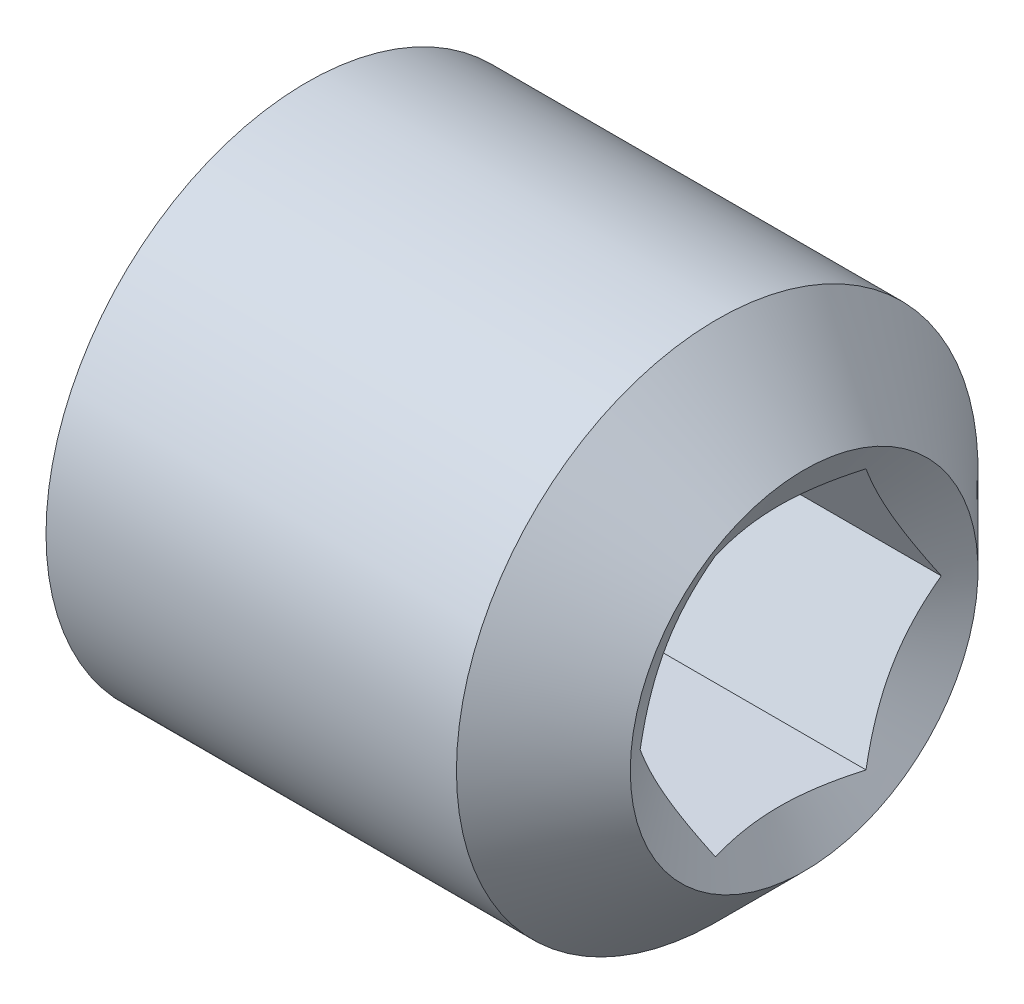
ISO-10303-21;
HEADER;
FILE_DESCRIPTION(('STEP AP214'),'2;1');
FILE_NAME('part.step','',(''),(''),'','','');
FILE_SCHEMA(('AUTOMOTIVE_DESIGN { 1 0 10303 214 1 1 1 1 }'));
ENDSEC;
DATA;
#1=APPLICATION_CONTEXT('core data for automotive mechanical design processes');
#2=APPLICATION_PROTOCOL_DEFINITION('international standard','automotive_design',2000,#1);
#3=PRODUCT_CONTEXT('',#1,'mechanical');
#4=PRODUCT('Part','Part','',(#3));
#5=PRODUCT_RELATED_PRODUCT_CATEGORY('part','',(#4));
#6=PRODUCT_DEFINITION_FORMATION('','',#4);
#7=PRODUCT_DEFINITION_CONTEXT('part definition',#1,'design');
#8=PRODUCT_DEFINITION('design','',#6,#7);
#9=PRODUCT_DEFINITION_SHAPE('','',#8);
#10=(LENGTH_UNIT() NAMED_UNIT(*) SI_UNIT(.MILLI.,.METRE.));
#11=(NAMED_UNIT(*) PLANE_ANGLE_UNIT() SI_UNIT($,.RADIAN.));
#12=(NAMED_UNIT(*) SI_UNIT($,.STERADIAN.) SOLID_ANGLE_UNIT());
#13=UNCERTAINTY_MEASURE_WITH_UNIT(LENGTH_MEASURE(1.E-05),#10,'distance_accuracy_value','');
#14=(GEOMETRIC_REPRESENTATION_CONTEXT(3) GLOBAL_UNCERTAINTY_ASSIGNED_CONTEXT((#13)) GLOBAL_UNIT_ASSIGNED_CONTEXT((#10,
#11,#12)) REPRESENTATION_CONTEXT('',''));
#15=CARTESIAN_POINT('',(0.,0.,0.));
#16=DIRECTION('',(0.,0.,1.));
#17=DIRECTION('',(1.,0.,0.));
#18=AXIS2_PLACEMENT_3D('',#15,#16,#17);
#19=CARTESIAN_POINT('',(0.,0.,0.));
#20=DIRECTION('',(-1.,0.,0.));
#21=DIRECTION('',(0.,0.,1.));
#22=AXIS2_PLACEMENT_3D('',#19,#20,#21);
#23=PLANE('',#22);
#24=CARTESIAN_POINT('',(0.,0.,0.));
#25=DIRECTION('',(-1.,0.,0.));
#26=DIRECTION('',(0.,0.,1.));
#27=AXIS2_PLACEMENT_3D('',#24,#25,#26);
#28=CIRCLE('',#27,5.036);
#29=CARTESIAN_POINT('',(0.,0.,5.036));
#30=VERTEX_POINT('',#29);
#31=EDGE_CURVE('E138',#30,#30,#28,.T.);
#32=ORIENTED_EDGE('',*,*,#31,.T.);
#33=EDGE_LOOP('',(#32));
#34=FACE_BOUND('',#33,.T.);
#35=DIRECTION('',(0.,0.,-1.));
#36=VECTOR('',#35,1.);
#37=CARTESIAN_POINT('',(0.,3.,1.73205080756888));
#38=LINE('',#37,#36);
#39=CARTESIAN_POINT('',(0.,3.,1.73205080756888));
#40=VERTEX_POINT('',#39);
#41=CARTESIAN_POINT('',(0.,3.,-1.73205080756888));
#42=VERTEX_POINT('',#41);
#43=EDGE_CURVE('E109',#40,#42,#38,.T.);
#44=ORIENTED_EDGE('',*,*,#43,.F.);
#45=DIRECTION('',(0.,-0.866025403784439,0.5));
#46=VECTOR('',#45,1.);
#47=CARTESIAN_POINT('',(0.,3.,1.73205080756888));
#48=LINE('',#47,#46);
#49=CARTESIAN_POINT('',(0.,0.,3.46410161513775));
#50=VERTEX_POINT('',#49);
#51=EDGE_CURVE('E53',#40,#50,#48,.T.);
#52=ORIENTED_EDGE('',*,*,#51,.T.);
#53=DIRECTION('',(0.,0.866025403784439,0.5));
#54=VECTOR('',#53,1.);
#55=CARTESIAN_POINT('',(0.,-3.,1.73205080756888));
#56=LINE('',#55,#54);
#57=CARTESIAN_POINT('',(0.,-3.,1.73205080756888));
#58=VERTEX_POINT('',#57);
#59=EDGE_CURVE('E99',#58,#50,#56,.T.);
#60=ORIENTED_EDGE('',*,*,#59,.F.);
#61=DIRECTION('',(0.,0.,-1.));
#62=VECTOR('',#61,1.);
#63=CARTESIAN_POINT('',(0.,-3.,1.73205080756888));
#64=LINE('',#63,#62);
#65=CARTESIAN_POINT('',(0.,-3.,-1.73205080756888));
#66=VERTEX_POINT('',#65);
#67=EDGE_CURVE('E105',#58,#66,#64,.T.);
#68=ORIENTED_EDGE('',*,*,#67,.T.);
#69=DIRECTION('',(0.,0.866025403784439,-0.5));
#70=VECTOR('',#69,1.);
#71=CARTESIAN_POINT('',(0.,-3.,-1.73205080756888));
#72=LINE('',#71,#70);
#73=CARTESIAN_POINT('',(0.,0.,-3.46410161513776));
#74=VERTEX_POINT('',#73);
#75=EDGE_CURVE('E113',#66,#74,#72,.T.);
#76=ORIENTED_EDGE('',*,*,#75,.T.);
#77=DIRECTION('',(0.,-0.866025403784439,-0.5));
#78=VECTOR('',#77,1.);
#79=CARTESIAN_POINT('',(0.,3.,-1.73205080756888));
#80=LINE('',#79,#78);
#81=EDGE_CURVE('E116',#42,#74,#80,.T.);
#82=ORIENTED_EDGE('',*,*,#81,.F.);
#83=EDGE_LOOP('',(#44,#52,#60,#68,#76,#82));
#84=FACE_BOUND('',#83,.T.);
#85=ADVANCED_FACE('F34',(#34,#84),#23,.T.);
#86=CARTESIAN_POINT('',(9.69059892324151,0.,0.));
#87=DIRECTION('',(1.,0.,0.));
#88=DIRECTION('',(0.,0.,-1.));
#89=AXIS2_PLACEMENT_3D('',#86,#87,#88);
#90=CONICAL_SURFACE('',#89,0.,1.0471975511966);
#91=CARTESIAN_POINT('',(12.,0.,0.));
#92=DIRECTION('',(-1.,0.,0.));
#93=DIRECTION('',(0.,0.,1.));
#94=AXIS2_PLACEMENT_3D('',#91,#92,#93);
#95=CIRCLE('',#94,4.);
#96=CARTESIAN_POINT('',(12.,0.,4.));
#97=VERTEX_POINT('',#96);
#98=EDGE_CURVE('E95',#97,#97,#95,.T.);
#99=ORIENTED_EDGE('',*,*,#98,.F.);
#100=EDGE_LOOP('',(#99));
#101=FACE_BOUND('',#100,.T.);
#102=CARTESIAN_POINT('',(11.6906655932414,3.0002,1.73193533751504));
#103=CARTESIAN_POINT('',(11.6467034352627,2.86836479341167,1.80805042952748));
#104=CARTESIAN_POINT('',(11.606721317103,2.73539159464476,1.88482254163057));
#105=CARTESIAN_POINT('',(11.5369318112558,2.46714257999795,2.03969618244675));
#106=CARTESIAN_POINT('',(11.5071491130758,2.33186199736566,2.11780046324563));
#107=CARTESIAN_POINT('',(11.4607875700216,2.06297739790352,2.27304105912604));
#108=CARTESIAN_POINT('',(11.4439001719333,1.92941475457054,2.35015348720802));
#109=CARTESIAN_POINT('',(11.4237393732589,1.66166094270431,2.50474122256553));
#110=CARTESIAN_POINT('',(11.4204492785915,1.52747074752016,2.58221596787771));
#111=CARTESIAN_POINT('',(11.4272902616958,1.2767244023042,2.72698443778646));
#112=CARTESIAN_POINT('',(11.435741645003,1.16013073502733,2.79429982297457));
#113=CARTESIAN_POINT('',(11.4625286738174,0.927703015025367,2.92849202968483));
#114=CARTESIAN_POINT('',(11.4808734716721,0.811869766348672,2.99536838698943));
#115=CARTESIAN_POINT('',(11.5267344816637,0.578962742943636,3.12983731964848));
#116=CARTESIAN_POINT('',(11.5544451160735,0.461918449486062,3.19741287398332));
#117=CARTESIAN_POINT('',(11.6173375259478,0.229575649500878,3.33155605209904));
#118=CARTESIAN_POINT('',(11.6525045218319,0.114274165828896,3.39812539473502));
#119=CARTESIAN_POINT('',(11.6906655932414,-0.000199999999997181,3.46421708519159));
#120=B_SPLINE_CURVE_WITH_KNOTS('',3,(#102,#103,#104,#105,#106,#107,#108,#109,#110,#111,#112,
#113,#114,#115,#116,#117,#118,#119),.UNSPECIFIED.,.F.,.F.,(4,2,2,2,2,2,2,2,4),(0.,
0.475539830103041,0.952222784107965,1.41710776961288,1.88142182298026,2.28572436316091,
2.69040156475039,3.10405572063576,3.5168974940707),.UNSPECIFIED.);
#121=CARTESIAN_POINT('',(11.6905989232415,3.,1.73205080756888));
#122=VERTEX_POINT('',#121);
#123=CARTESIAN_POINT('',(11.6905989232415,0.,3.46410161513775));
#124=VERTEX_POINT('',#123);
#125=EDGE_CURVE('E11',#122,#124,#120,.T.);
#126=ORIENTED_EDGE('',*,*,#125,.F.);
#127=CARTESIAN_POINT('',(12.840336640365,3.,-4.55659336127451));
#128=CARTESIAN_POINT('',(12.7775183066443,3.,-4.42628672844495));
#129=CARTESIAN_POINT('',(12.7153309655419,3.,-4.29567032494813));
#130=CARTESIAN_POINT('',(12.5925754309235,3.,-4.03365274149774));
#131=CARTESIAN_POINT('',(12.5320075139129,3.,-3.90225143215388));
#132=CARTESIAN_POINT('',(12.4125226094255,3.,-3.63777496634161));
#133=CARTESIAN_POINT('',(12.3536172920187,3.,-3.50469451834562));
#134=CARTESIAN_POINT('',(12.2383508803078,3.,-3.23744031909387));
#135=CARTESIAN_POINT('',(12.1819896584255,3.,-3.10326662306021));
#136=CARTESIAN_POINT('',(12.0709277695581,3.,-2.82977330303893));
#137=CARTESIAN_POINT('',(12.0163198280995,3.,-2.69041580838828));
#138=CARTESIAN_POINT('',(11.9114740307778,3.,-2.41003573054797));
#139=CARTESIAN_POINT('',(11.8612366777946,3.,-2.26901295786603));
#140=CARTESIAN_POINT('',(11.7665209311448,3.,-1.98537413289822));
#141=CARTESIAN_POINT('',(11.7220300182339,3.,-1.84276230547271));
#142=CARTESIAN_POINT('',(11.6402969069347,3.,-1.55549698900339));
#143=CARTESIAN_POINT('',(11.6030523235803,3.,-1.41084418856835));
#144=CARTESIAN_POINT('',(11.537839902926,3.,-1.12014497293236));
#145=CARTESIAN_POINT('',(11.5098288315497,3.,-0.974108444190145));
#146=CARTESIAN_POINT('',(11.4647495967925,3.,-0.680325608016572));
#147=CARTESIAN_POINT('',(11.4476805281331,3.,-0.532579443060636));
#148=CARTESIAN_POINT('',(11.4260708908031,3.,-0.23800167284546));
#149=CARTESIAN_POINT('',(11.421376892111,3.,-0.0911816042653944));
#150=CARTESIAN_POINT('',(11.4245169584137,3.,0.202335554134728));
#151=CARTESIAN_POINT('',(11.4323516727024,3.,0.349032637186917));
#152=CARTESIAN_POINT('',(11.4560257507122,3.,0.600951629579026));
#153=CARTESIAN_POINT('',(11.469060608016,3.,0.706450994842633));
#154=CARTESIAN_POINT('',(11.5007453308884,3.,0.916609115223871));
#155=CARTESIAN_POINT('',(11.5193960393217,3.,1.02126774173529));
#156=CARTESIAN_POINT('',(11.5827840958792,3.,1.33387598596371));
#157=CARTESIAN_POINT('',(11.6349442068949,3.,1.54033357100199));
#158=CARTESIAN_POINT('',(11.7245575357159,3.,1.84908487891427));
#159=CARTESIAN_POINT('',(11.7567482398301,3.,1.95299589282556));
#160=CARTESIAN_POINT('',(11.8242569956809,3.,2.1598068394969));
#161=CARTESIAN_POINT('',(11.8595750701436,3.,2.2627067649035));
#162=CARTESIAN_POINT('',(11.9327896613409,3.,2.46753423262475));
#163=CARTESIAN_POINT('',(11.9706852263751,3.,2.5694621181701));
#164=CARTESIAN_POINT('',(12.0486305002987,3.,2.77248625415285));
#165=CARTESIAN_POINT('',(12.0886801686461,3.,2.87358252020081));
#166=CARTESIAN_POINT('',(12.1962687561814,3.,3.13826972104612));
#167=CARTESIAN_POINT('',(12.2652842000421,3.,3.30125980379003));
#168=CARTESIAN_POINT('',(12.4068707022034,3.,3.62569332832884));
#169=CARTESIAN_POINT('',(12.4794420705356,3.,3.78713663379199));
#170=CARTESIAN_POINT('',(12.627315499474,3.,4.10881818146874));
#171=CARTESIAN_POINT('',(12.7026183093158,3.00000000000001,4.26905607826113));
#172=CARTESIAN_POINT('',(12.8553307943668,3.00000000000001,4.58852645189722));
#173=CARTESIAN_POINT('',(12.9327405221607,3.00000000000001,4.74775890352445));
#174=CARTESIAN_POINT('',(13.1676336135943,3.00000000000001,5.22465756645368));
#175=CARTESIAN_POINT('',(13.327585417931,3.00000000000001,5.54110663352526));
#176=CARTESIAN_POINT('',(13.6516726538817,3.00000000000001,6.17177335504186));
#177=CARTESIAN_POINT('',(13.8158073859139,3.00000000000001,6.48599137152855));
#178=CARTESIAN_POINT('',(14.1305139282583,3.00000000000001,7.08177137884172));
#179=CARTESIAN_POINT('',(14.2808137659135,3.00000000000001,7.36347726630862));
#180=CARTESIAN_POINT('',(14.5831324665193,3.00000000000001,7.92598154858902));
#181=CARTESIAN_POINT('',(14.7351514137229,3.00000000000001,8.20677989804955));
#182=CARTESIAN_POINT('',(15.040043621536,3.00000000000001,8.76689184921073));
#183=CARTESIAN_POINT('',(15.1929132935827,3.00000000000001,9.04620740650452));
#184=CARTESIAN_POINT('',(15.4996413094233,3.00000000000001,9.60427181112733));
#185=CARTESIAN_POINT('',(15.653499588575,3.00000000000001,9.88302069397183));
#186=CARTESIAN_POINT('',(15.8077189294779,3.00000000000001,10.1615683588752));
#187=B_SPLINE_CURVE_WITH_KNOTS('',3,(#127,#128,#129,#130,#131,#132,#133,#134,#135,#136,#137,
#138,#139,#140,#141,#142,#143,#144,#145,#146,#147,#148,#149,#150,#151,#152,#153,#154,#155,#156,
#157,#158,#159,#160,#161,#162,#163,#164,#165,#166,#167,#168,#169,#170,#171,#172,#173,#174,#175,
#176,#177,#178,#179,#180,#181,#182,#183,#184,#185,#186),.UNSPECIFIED.,.F.,.F.,(4,2,2,2,2,2,2,2,
2,2,2,2,2,2,2,2,2,2,2,2,2,2,2,2,2,2,2,2,2,4),(0.,0.433980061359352,0.868033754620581,
1.30461549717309,1.74117532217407,2.19014305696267,2.63916238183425,3.08718634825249,
3.53506260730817,3.98081095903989,4.42652242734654,4.86668125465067,5.30686289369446,
5.62561131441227,5.94440759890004,6.58237376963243,6.9086979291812,7.23502446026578,
7.56123114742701,7.88743169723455,8.41836853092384,8.94935173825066,9.48048171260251,
10.0116249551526,11.0752966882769,12.138791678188,13.0966636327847,14.0545827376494,
15.0098170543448,15.9649895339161),.UNSPECIFIED.);
#188=CARTESIAN_POINT('',(11.6905989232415,3.,-1.73205080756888));
#189=VERTEX_POINT('',#188);
#190=EDGE_CURVE('E141',#122,#189,#187,.F.);
#191=ORIENTED_EDGE('',*,*,#190,.T.);
#192=CARTESIAN_POINT('',(11.6906655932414,3.0002,-1.73193533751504));
#193=CARTESIAN_POINT('',(11.6467034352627,2.86836479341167,-1.80805042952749));
#194=CARTESIAN_POINT('',(11.606721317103,2.73539159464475,-1.88482254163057));
#195=CARTESIAN_POINT('',(11.5369318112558,2.46714257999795,-2.03969618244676));
#196=CARTESIAN_POINT('',(11.5071491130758,2.33186199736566,-2.11780046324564));
#197=CARTESIAN_POINT('',(11.4607875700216,2.06297739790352,-2.27304105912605));
#198=CARTESIAN_POINT('',(11.4439001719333,1.92941475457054,-2.35015348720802));
#199=CARTESIAN_POINT('',(11.4237393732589,1.66166094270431,-2.50474122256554));
#200=CARTESIAN_POINT('',(11.4204492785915,1.52747074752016,-2.58221596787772));
#201=CARTESIAN_POINT('',(11.4272902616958,1.27672440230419,-2.72698443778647));
#202=CARTESIAN_POINT('',(11.435741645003,1.16013073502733,-2.79429982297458));
#203=CARTESIAN_POINT('',(11.4625286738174,0.927703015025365,-2.92849202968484));
#204=CARTESIAN_POINT('',(11.4808734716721,0.81186976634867,-2.99536838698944));
#205=CARTESIAN_POINT('',(11.5267344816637,0.578962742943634,-3.12983731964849));
#206=CARTESIAN_POINT('',(11.5544451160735,0.461918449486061,-3.19741287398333));
#207=CARTESIAN_POINT('',(11.6173375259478,0.229575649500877,-3.33155605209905));
#208=CARTESIAN_POINT('',(11.6525045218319,0.114274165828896,-3.39812539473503));
#209=CARTESIAN_POINT('',(11.6906655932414,-0.000199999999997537,-3.4642170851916));
#210=B_SPLINE_CURVE_WITH_KNOTS('',3,(#192,#193,#194,#195,#196,#197,#198,#199,#200,#201,#202,
#203,#204,#205,#206,#207,#208,#209),.UNSPECIFIED.,.F.,.F.,(4,2,2,2,2,2,2,2,4),(0.,
0.475539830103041,0.952222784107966,1.41710776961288,1.88142182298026,2.28572436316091,
2.69040156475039,3.10405572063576,3.5168974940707),.UNSPECIFIED.);
#211=CARTESIAN_POINT('',(11.6905989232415,0.,-3.46410161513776));
#212=VERTEX_POINT('',#211);
#213=EDGE_CURVE('E148',#189,#212,#210,.T.);
#214=ORIENTED_EDGE('',*,*,#213,.T.);
#215=CARTESIAN_POINT('',(11.6906655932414,-3.0002,-1.73193533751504));
#216=CARTESIAN_POINT('',(11.6467034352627,-2.86836479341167,-1.80805042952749));
#217=CARTESIAN_POINT('',(11.606721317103,-2.73539159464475,-1.88482254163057));
#218=CARTESIAN_POINT('',(11.5369318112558,-2.46714257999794,-2.03969618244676));
#219=CARTESIAN_POINT('',(11.5071491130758,-2.33186199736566,-2.11780046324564));
#220=CARTESIAN_POINT('',(11.4607875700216,-2.06297739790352,-2.27304105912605));
#221=CARTESIAN_POINT('',(11.4439001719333,-1.92941475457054,-2.35015348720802));
#222=CARTESIAN_POINT('',(11.4237393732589,-1.66166094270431,-2.50474122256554));
#223=CARTESIAN_POINT('',(11.4204492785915,-1.52747074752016,-2.58221596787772));
#224=CARTESIAN_POINT('',(11.4272902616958,-1.27672440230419,-2.72698443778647));
#225=CARTESIAN_POINT('',(11.435741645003,-1.16013073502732,-2.79429982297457));
#226=CARTESIAN_POINT('',(11.4625286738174,-0.927703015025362,-2.92849202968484));
#227=CARTESIAN_POINT('',(11.4808734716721,-0.811869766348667,-2.99536838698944));
#228=CARTESIAN_POINT('',(11.5267344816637,-0.57896274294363,-3.12983731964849));
#229=CARTESIAN_POINT('',(11.5544451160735,-0.461918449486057,-3.19741287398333));
#230=CARTESIAN_POINT('',(11.6173375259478,-0.229575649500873,-3.33155605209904));
#231=CARTESIAN_POINT('',(11.6525045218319,-0.114274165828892,-3.39812539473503));
#232=CARTESIAN_POINT('',(11.6906655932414,0.000200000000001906,-3.4642170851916));
#233=B_SPLINE_CURVE_WITH_KNOTS('',3,(#215,#216,#217,#218,#219,#220,#221,#222,#223,#224,#225,
#226,#227,#228,#229,#230,#231,#232),.UNSPECIFIED.,.F.,.F.,(4,2,2,2,2,2,2,2,4),(0.,
0.475539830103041,0.952222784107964,1.41710776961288,1.88142182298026,2.28572436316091,
2.69040156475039,3.10405572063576,3.5168974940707),.UNSPECIFIED.);
#234=CARTESIAN_POINT('',(11.6905989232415,-3.,-1.73205080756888));
#235=VERTEX_POINT('',#234);
#236=EDGE_CURVE('E171',#235,#212,#233,.T.);
#237=ORIENTED_EDGE('',*,*,#236,.F.);
#238=CARTESIAN_POINT('',(12.840336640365,-3.,-4.55659336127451));
#239=CARTESIAN_POINT('',(12.7775183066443,-3.,-4.42628672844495));
#240=CARTESIAN_POINT('',(12.7153309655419,-3.,-4.29567032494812));
#241=CARTESIAN_POINT('',(12.5925754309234,-3.,-4.03365274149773));
#242=CARTESIAN_POINT('',(12.5320075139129,-3.,-3.90225143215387));
#243=CARTESIAN_POINT('',(12.4125226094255,-3.,-3.63777496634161));
#244=CARTESIAN_POINT('',(12.3536172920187,-3.,-3.50469451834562));
#245=CARTESIAN_POINT('',(12.2383508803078,-3.,-3.23744031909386));
#246=CARTESIAN_POINT('',(12.1819896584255,-3.,-3.10326662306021));
#247=CARTESIAN_POINT('',(12.0709277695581,-3.,-2.82977330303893));
#248=CARTESIAN_POINT('',(12.0163198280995,-3.,-2.69041580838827));
#249=CARTESIAN_POINT('',(11.9114740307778,-3.,-2.41003573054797));
#250=CARTESIAN_POINT('',(11.8612366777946,-3.,-2.26901295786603));
#251=CARTESIAN_POINT('',(11.7665209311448,-3.,-1.98537413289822));
#252=CARTESIAN_POINT('',(11.7220300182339,-3.,-1.84276230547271));
#253=CARTESIAN_POINT('',(11.6402969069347,-3.,-1.55549698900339));
#254=CARTESIAN_POINT('',(11.6030523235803,-3.,-1.41084418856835));
#255=CARTESIAN_POINT('',(11.537839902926,-3.,-1.12014497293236));
#256=CARTESIAN_POINT('',(11.5098288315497,-3.,-0.974108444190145));
#257=CARTESIAN_POINT('',(11.4647495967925,-3.,-0.680325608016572));
#258=CARTESIAN_POINT('',(11.4476805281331,-3.,-0.532579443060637));
#259=CARTESIAN_POINT('',(11.4260708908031,-3.,-0.238001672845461));
#260=CARTESIAN_POINT('',(11.421376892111,-3.,-0.0911816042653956));
#261=CARTESIAN_POINT('',(11.4245169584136,-3.,0.202335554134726));
#262=CARTESIAN_POINT('',(11.4323516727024,-3.,0.349032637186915));
#263=CARTESIAN_POINT('',(11.4560257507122,-3.,0.600951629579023));
#264=CARTESIAN_POINT('',(11.469060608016,-3.,0.70645099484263));
#265=CARTESIAN_POINT('',(11.5007453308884,-3.,0.916609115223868));
#266=CARTESIAN_POINT('',(11.5193960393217,-3.,1.02126774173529));
#267=CARTESIAN_POINT('',(11.5827840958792,-3.,1.33387598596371));
#268=CARTESIAN_POINT('',(11.6349442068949,-3.,1.54033357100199));
#269=CARTESIAN_POINT('',(11.7245575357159,-3.,1.84908487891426));
#270=CARTESIAN_POINT('',(11.7567482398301,-3.,1.95299589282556));
#271=CARTESIAN_POINT('',(11.8242569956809,-3.,2.15980683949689));
#272=CARTESIAN_POINT('',(11.8595750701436,-3.,2.2627067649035));
#273=CARTESIAN_POINT('',(11.9327896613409,-3.,2.46753423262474));
#274=CARTESIAN_POINT('',(11.9706852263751,-3.,2.56946211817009));
#275=CARTESIAN_POINT('',(12.0486305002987,-3.,2.77248625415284));
#276=CARTESIAN_POINT('',(12.0886801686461,-3.,2.8735825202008));
#277=CARTESIAN_POINT('',(12.1962687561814,-3.,3.13826972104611));
#278=CARTESIAN_POINT('',(12.2652842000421,-3.,3.30125980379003));
#279=CARTESIAN_POINT('',(12.4068707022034,-3.,3.62569332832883));
#280=CARTESIAN_POINT('',(12.4794420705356,-3.,3.78713663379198));
#281=CARTESIAN_POINT('',(12.627315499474,-3.,4.10881818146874));
#282=CARTESIAN_POINT('',(12.7026183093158,-3.,4.26905607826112));
#283=CARTESIAN_POINT('',(12.8553307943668,-3.,4.58852645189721));
#284=CARTESIAN_POINT('',(12.9327405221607,-3.,4.74775890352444));
#285=CARTESIAN_POINT('',(13.1676336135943,-3.,5.22465756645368));
#286=CARTESIAN_POINT('',(13.327585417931,-3.,5.54110663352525));
#287=CARTESIAN_POINT('',(13.6516726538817,-3.,6.17177335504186));
#288=CARTESIAN_POINT('',(13.8158073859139,-3.,6.48599137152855));
#289=CARTESIAN_POINT('',(14.1305139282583,-3.,7.08177137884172));
#290=CARTESIAN_POINT('',(14.2808137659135,-3.,7.36347726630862));
#291=CARTESIAN_POINT('',(14.5831324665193,-3.,7.92598154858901));
#292=CARTESIAN_POINT('',(14.7351514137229,-3.,8.20677989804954));
#293=CARTESIAN_POINT('',(15.040043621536,-3.,8.76689184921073));
#294=CARTESIAN_POINT('',(15.1929132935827,-3.,9.04620740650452));
#295=CARTESIAN_POINT('',(15.4996413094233,-3.,9.60427181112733));
#296=CARTESIAN_POINT('',(15.653499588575,-3.,9.88302069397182));
#297=CARTESIAN_POINT('',(15.8077189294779,-3.,10.1615683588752));
#298=B_SPLINE_CURVE_WITH_KNOTS('',3,(#238,#239,#240,#241,#242,#243,#244,#245,#246,#247,#248,
#249,#250,#251,#252,#253,#254,#255,#256,#257,#258,#259,#260,#261,#262,#263,#264,#265,#266,#267,
#268,#269,#270,#271,#272,#273,#274,#275,#276,#277,#278,#279,#280,#281,#282,#283,#284,#285,#286,
#287,#288,#289,#290,#291,#292,#293,#294,#295,#296,#297),.UNSPECIFIED.,.F.,.F.,(4,2,2,2,2,2,2,2,
2,2,2,2,2,2,2,2,2,2,2,2,2,2,2,2,2,2,2,2,2,4),(0.,0.433980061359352,0.868033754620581,
1.30461549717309,1.74117532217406,2.19014305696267,2.63916238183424,3.08718634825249,
3.53506260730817,3.98081095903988,4.42652242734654,4.86668125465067,5.30686289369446,
5.62561131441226,5.94440759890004,6.58237376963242,6.90869792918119,7.23502446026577,
7.561231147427,7.88743169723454,8.41836853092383,8.94935173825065,9.48048171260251,
10.0116249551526,11.0752966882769,12.138791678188,13.0966636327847,14.0545827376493,
15.0098170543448,15.9649895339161),.UNSPECIFIED.);
#299=CARTESIAN_POINT('',(11.6905989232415,-3.,1.73205080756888));
#300=VERTEX_POINT('',#299);
#301=EDGE_CURVE('E177',#300,#235,#298,.F.);
#302=ORIENTED_EDGE('',*,*,#301,.F.);
#303=CARTESIAN_POINT('',(11.6906655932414,-3.0002,1.73193533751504));
#304=CARTESIAN_POINT('',(11.6467034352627,-2.86836479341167,1.80805042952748));
#305=CARTESIAN_POINT('',(11.606721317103,-2.73539159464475,1.88482254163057));
#306=CARTESIAN_POINT('',(11.5369318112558,-2.46714257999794,2.03969618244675));
#307=CARTESIAN_POINT('',(11.5071491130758,-2.33186199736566,2.11780046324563));
#308=CARTESIAN_POINT('',(11.4607875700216,-2.06297739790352,2.27304105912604));
#309=CARTESIAN_POINT('',(11.4439001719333,-1.92941475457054,2.35015348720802));
#310=CARTESIAN_POINT('',(11.4237393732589,-1.66166094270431,2.50474122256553));
#311=CARTESIAN_POINT('',(11.4204492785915,-1.52747074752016,2.58221596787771));
#312=CARTESIAN_POINT('',(11.4272902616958,-1.27672440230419,2.72698443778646));
#313=CARTESIAN_POINT('',(11.435741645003,-1.16013073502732,2.79429982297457));
#314=CARTESIAN_POINT('',(11.4625286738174,-0.927703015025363,2.92849202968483));
#315=CARTESIAN_POINT('',(11.4808734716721,-0.811869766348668,2.99536838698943));
#316=CARTESIAN_POINT('',(11.5267344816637,-0.578962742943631,3.12983731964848));
#317=CARTESIAN_POINT('',(11.5544451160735,-0.461918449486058,3.19741287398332));
#318=CARTESIAN_POINT('',(11.6173375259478,-0.229575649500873,3.33155605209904));
#319=CARTESIAN_POINT('',(11.6525045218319,-0.114274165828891,3.39812539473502));
#320=CARTESIAN_POINT('',(11.6906655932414,0.000200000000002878,3.46421708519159));
#321=B_SPLINE_CURVE_WITH_KNOTS('',3,(#303,#304,#305,#306,#307,#308,#309,#310,#311,#312,#313,
#314,#315,#316,#317,#318,#319,#320),.UNSPECIFIED.,.F.,.F.,(4,2,2,2,2,2,2,2,4),(0.,
0.47553983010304,0.952222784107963,1.41710776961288,1.88142182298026,2.28572436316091,
2.69040156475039,3.10405572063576,3.5168974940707),.UNSPECIFIED.);
#322=EDGE_CURVE('E46',#300,#124,#321,.T.);
#323=ORIENTED_EDGE('',*,*,#322,.T.);
#324=EDGE_LOOP('',(#126,#191,#214,#237,#302,#323));
#325=FACE_BOUND('',#324,.T.);
#326=ADVANCED_FACE('F156',(#101,#325),#90,.F.);
#327=CARTESIAN_POINT('',(0.,0.,0.));
#328=DIRECTION('',(1.,0.,0.));
#329=DIRECTION('',(0.,0.,-1.));
#330=AXIS2_PLACEMENT_3D('',#327,#328,#329);
#331=CONICAL_SURFACE('',#330,5.036,1.0471975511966);
#332=CARTESIAN_POINT('',(0.556565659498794,0.,0.));
#333=DIRECTION('',(-1.,0.,0.));
#334=DIRECTION('',(0.,0.,1.));
#335=AXIS2_PLACEMENT_3D('',#332,#333,#334);
#336=CIRCLE('',#335,6.);
#337=CARTESIAN_POINT('',(0.556565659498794,0.,6.));
#338=VERTEX_POINT('',#337);
#339=EDGE_CURVE('E135',#338,#338,#336,.T.);
#340=ORIENTED_EDGE('',*,*,#339,.T.);
#341=EDGE_LOOP('',(#340));
#342=FACE_BOUND('',#341,.T.);
#343=ORIENTED_EDGE('',*,*,#31,.F.);
#344=EDGE_LOOP('',(#343));
#345=FACE_BOUND('',#344,.T.);
#346=ADVANCED_FACE('F160',(#342,#345),#331,.T.);
#347=CARTESIAN_POINT('',(-12.7,0.,0.));
#348=DIRECTION('',(-1.,0.,0.));
#349=DIRECTION('',(0.,0.,1.));
#350=AXIS2_PLACEMENT_3D('',#347,#348,#349);
#351=CYLINDRICAL_SURFACE('',#350,6.);
#352=CARTESIAN_POINT('',(10.,0.,0.));
#353=DIRECTION('',(-1.,0.,0.));
#354=DIRECTION('',(0.,0.,1.));
#355=AXIS2_PLACEMENT_3D('',#352,#353,#354);
#356=CIRCLE('',#355,6.);
#357=CARTESIAN_POINT('',(10.,0.,6.));
#358=VERTEX_POINT('',#357);
#359=EDGE_CURVE('E132',#358,#358,#356,.T.);
#360=ORIENTED_EDGE('',*,*,#359,.T.);
#361=EDGE_LOOP('',(#360));
#362=FACE_BOUND('',#361,.T.);
#363=ORIENTED_EDGE('',*,*,#339,.F.);
#364=EDGE_LOOP('',(#363));
#365=FACE_BOUND('',#364,.T.);
#366=ADVANCED_FACE('F209',(#362,#365),#351,.T.);
#367=CARTESIAN_POINT('',(10.,0.,0.));
#368=DIRECTION('',(-1.,0.,0.));
#369=DIRECTION('',(0.,0.,1.));
#370=AXIS2_PLACEMENT_3D('',#367,#368,#369);
#371=CONICAL_SURFACE('',#370,6.,0.78539816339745);
#372=ORIENTED_EDGE('',*,*,#98,.T.);
#373=EDGE_LOOP('',(#372));
#374=FACE_BOUND('',#373,.T.);
#375=ORIENTED_EDGE('',*,*,#359,.F.);
#376=EDGE_LOOP('',(#375));
#377=FACE_BOUND('',#376,.T.);
#378=ADVANCED_FACE('F164',(#374,#377),#371,.T.);
#379=CARTESIAN_POINT('',(12.,3.,1.73205080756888));
#380=DIRECTION('',(0.,-0.5,-0.866025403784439));
#381=DIRECTION('',(0.,0.866025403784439,-0.5));
#382=AXIS2_PLACEMENT_3D('',#379,#380,#381);
#383=PLANE('',#382);
#384=ORIENTED_EDGE('',*,*,#125,.T.);
#385=DIRECTION('',(-1.,0.,0.));
#386=VECTOR('',#385,1.);
#387=CARTESIAN_POINT('',(12.,0.,3.46410161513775));
#388=LINE('',#387,#386);
#389=EDGE_CURVE('E89',#124,#50,#388,.T.);
#390=ORIENTED_EDGE('',*,*,#389,.T.);
#391=ORIENTED_EDGE('',*,*,#51,.F.);
#392=DIRECTION('',(-1.,0.,0.));
#393=VECTOR('',#392,1.);
#394=CARTESIAN_POINT('',(12.,3.,1.73205080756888));
#395=LINE('',#394,#393);
#396=EDGE_CURVE('E120',#122,#40,#395,.T.);
#397=ORIENTED_EDGE('',*,*,#396,.F.);
#398=EDGE_LOOP('',(#384,#390,#391,#397));
#399=FACE_BOUND('',#398,.T.);
#400=ADVANCED_FACE('F91',(#399),#383,.T.);
#401=CARTESIAN_POINT('',(12.,-3.,1.73205080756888));
#402=DIRECTION('',(0.,-0.5,0.866025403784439));
#403=DIRECTION('',(0.,-0.866025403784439,-0.5));
#404=AXIS2_PLACEMENT_3D('',#401,#402,#403);
#405=PLANE('',#404);
#406=DIRECTION('',(-1.,0.,0.));
#407=VECTOR('',#406,1.);
#408=CARTESIAN_POINT('',(12.,-3.,1.73205080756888));
#409=LINE('',#408,#407);
#410=EDGE_CURVE('E96',#300,#58,#409,.T.);
#411=ORIENTED_EDGE('',*,*,#410,.T.);
#412=ORIENTED_EDGE('',*,*,#59,.T.);
#413=ORIENTED_EDGE('',*,*,#389,.F.);
#414=ORIENTED_EDGE('',*,*,#322,.F.);
#415=EDGE_LOOP('',(#411,#412,#413,#414));
#416=FACE_BOUND('',#415,.T.);
#417=ADVANCED_FACE('F100',(#416),#405,.F.);
#418=CARTESIAN_POINT('',(12.,-3.,1.73205080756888));
#419=DIRECTION('',(0.,1.,0.));
#420=DIRECTION('',(0.,0.,1.));
#421=AXIS2_PLACEMENT_3D('',#418,#419,#420);
#422=PLANE('',#421);
#423=ORIENTED_EDGE('',*,*,#301,.T.);
#424=DIRECTION('',(-1.,0.,0.));
#425=VECTOR('',#424,1.);
#426=CARTESIAN_POINT('',(12.,-3.,-1.73205080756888));
#427=LINE('',#426,#425);
#428=EDGE_CURVE('E126',#235,#66,#427,.T.);
#429=ORIENTED_EDGE('',*,*,#428,.T.);
#430=ORIENTED_EDGE('',*,*,#67,.F.);
#431=ORIENTED_EDGE('',*,*,#410,.F.);
#432=EDGE_LOOP('',(#423,#429,#430,#431));
#433=FACE_BOUND('',#432,.T.);
#434=ADVANCED_FACE('F187',(#433),#422,.T.);
#435=CARTESIAN_POINT('',(12.,-3.,-1.73205080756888));
#436=DIRECTION('',(0.,0.5,0.866025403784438));
#437=DIRECTION('',(0.,-0.866025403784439,0.5));
#438=AXIS2_PLACEMENT_3D('',#435,#436,#437);
#439=PLANE('',#438);
#440=ORIENTED_EDGE('',*,*,#236,.T.);
#441=DIRECTION('',(-1.,0.,0.));
#442=VECTOR('',#441,1.);
#443=CARTESIAN_POINT('',(12.,0.,-3.46410161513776));
#444=LINE('',#443,#442);
#445=EDGE_CURVE('E124',#212,#74,#444,.T.);
#446=ORIENTED_EDGE('',*,*,#445,.T.);
#447=ORIENTED_EDGE('',*,*,#75,.F.);
#448=ORIENTED_EDGE('',*,*,#428,.F.);
#449=EDGE_LOOP('',(#440,#446,#447,#448));
#450=FACE_BOUND('',#449,.T.);
#451=ADVANCED_FACE('F190',(#450),#439,.T.);
#452=CARTESIAN_POINT('',(12.,3.,-1.73205080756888));
#453=DIRECTION('',(0.,0.5,-0.866025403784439));
#454=DIRECTION('',(0.,0.866025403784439,0.5));
#455=AXIS2_PLACEMENT_3D('',#452,#453,#454);
#456=PLANE('',#455);
#457=DIRECTION('',(-1.,0.,0.));
#458=VECTOR('',#457,1.);
#459=CARTESIAN_POINT('',(12.,3.,-1.73205080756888));
#460=LINE('',#459,#458);
#461=EDGE_CURVE('E61',#189,#42,#460,.T.);
#462=ORIENTED_EDGE('',*,*,#461,.T.);
#463=ORIENTED_EDGE('',*,*,#81,.T.);
#464=ORIENTED_EDGE('',*,*,#445,.F.);
#465=ORIENTED_EDGE('',*,*,#213,.F.);
#466=EDGE_LOOP('',(#462,#463,#464,#465));
#467=FACE_BOUND('',#466,.T.);
#468=ADVANCED_FACE('F194',(#467),#456,.F.);
#469=CARTESIAN_POINT('',(12.,3.,1.73205080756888));
#470=DIRECTION('',(0.,1.,0.));
#471=DIRECTION('',(0.,0.,1.));
#472=AXIS2_PLACEMENT_3D('',#469,#470,#471);
#473=PLANE('',#472);
#474=ORIENTED_EDGE('',*,*,#396,.T.);
#475=ORIENTED_EDGE('',*,*,#43,.T.);
#476=ORIENTED_EDGE('',*,*,#461,.F.);
#477=ORIENTED_EDGE('',*,*,#190,.F.);
#478=EDGE_LOOP('',(#474,#475,#476,#477));
#479=FACE_BOUND('',#478,.T.);
#480=ADVANCED_FACE('F154',(#479),#473,.F.);
#481=CLOSED_SHELL('',(#85,#326,#346,#366,#378,#400,#417,#434,#451,#468,#480));
#482=MANIFOLD_SOLID_BREP('B2',#481);
#483=ADVANCED_BREP_SHAPE_REPRESENTATION('',(#18,#482),#14);
#484=SHAPE_DEFINITION_REPRESENTATION(#9,#483);
ENDSEC;
END-ISO-10303-21;
